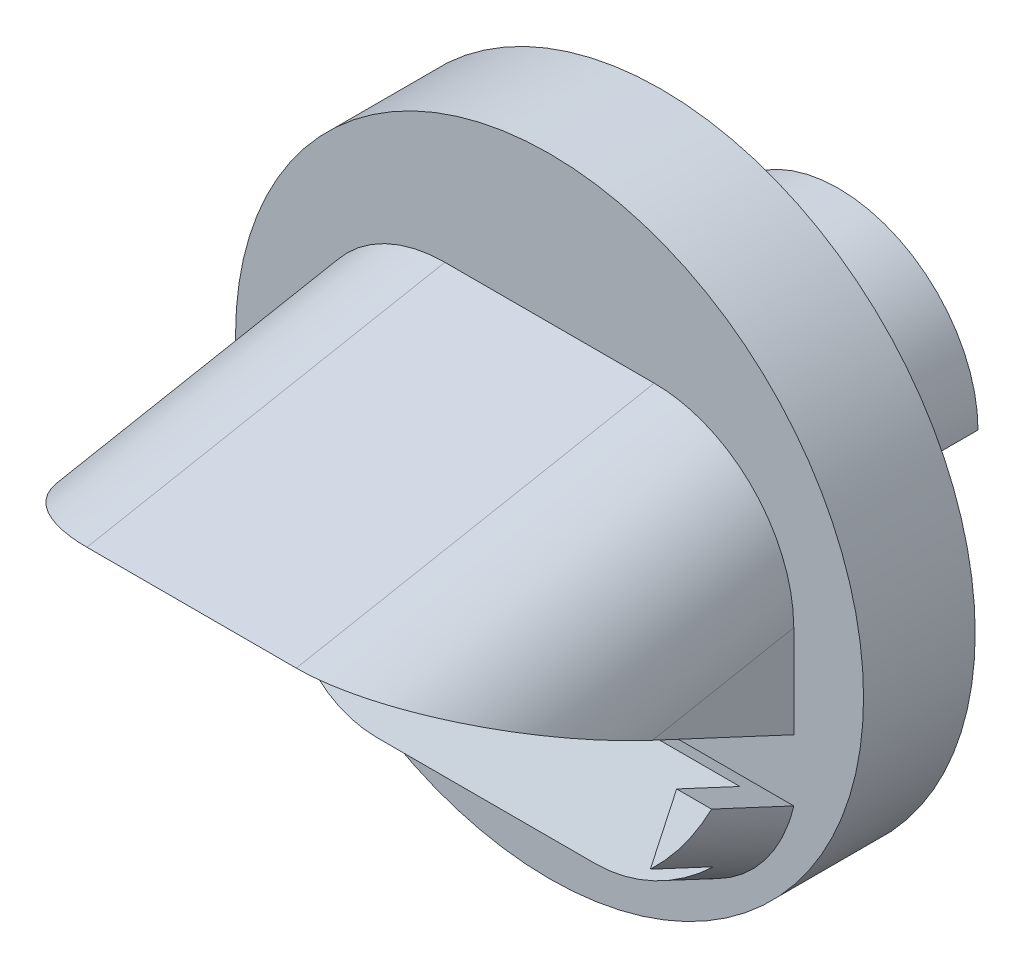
ISO-10303-21;
HEADER;
FILE_DESCRIPTION(('STEP AP214'),'2;1');
FILE_NAME('part.step','',(''),(''),'','','');
FILE_SCHEMA(('AUTOMOTIVE_DESIGN { 1 0 10303 214 1 1 1 1 }'));
ENDSEC;
DATA;
#1=APPLICATION_CONTEXT('core data for automotive mechanical design processes');
#2=APPLICATION_PROTOCOL_DEFINITION('international standard','automotive_design',2000,#1);
#3=PRODUCT_CONTEXT('',#1,'mechanical');
#4=PRODUCT('Part','Part','',(#3));
#5=PRODUCT_RELATED_PRODUCT_CATEGORY('part','',(#4));
#6=PRODUCT_DEFINITION_FORMATION('','',#4);
#7=PRODUCT_DEFINITION_CONTEXT('part definition',#1,'design');
#8=PRODUCT_DEFINITION('design','',#6,#7);
#9=PRODUCT_DEFINITION_SHAPE('','',#8);
#10=(LENGTH_UNIT() NAMED_UNIT(*) SI_UNIT(.MILLI.,.METRE.));
#11=(NAMED_UNIT(*) PLANE_ANGLE_UNIT() SI_UNIT($,.RADIAN.));
#12=(NAMED_UNIT(*) SI_UNIT($,.STERADIAN.) SOLID_ANGLE_UNIT());
#13=UNCERTAINTY_MEASURE_WITH_UNIT(LENGTH_MEASURE(1.E-05),#10,'distance_accuracy_value','');
#14=(GEOMETRIC_REPRESENTATION_CONTEXT(3) GLOBAL_UNCERTAINTY_ASSIGNED_CONTEXT((#13)) GLOBAL_UNIT_ASSIGNED_CONTEXT((#10,
#11,#12)) REPRESENTATION_CONTEXT('',''));
#15=CARTESIAN_POINT('',(0.,0.,0.));
#16=DIRECTION('',(0.,0.,1.));
#17=DIRECTION('',(1.,0.,0.));
#18=AXIS2_PLACEMENT_3D('',#15,#16,#17);
#19=CARTESIAN_POINT('',(0.,0.,20.7));
#20=DIRECTION('',(0.,0.,1.));
#21=DIRECTION('',(1.,0.,0.));
#22=AXIS2_PLACEMENT_3D('',#19,#20,#21);
#23=PLANE('',#22);
#24=CARTESIAN_POINT('',(0.,0.,20.7));
#25=DIRECTION('',(0.,0.,1.));
#26=DIRECTION('',(1.,0.,0.));
#27=AXIS2_PLACEMENT_3D('',#24,#25,#26);
#28=CIRCLE('',#27,22.5);
#29=CARTESIAN_POINT('',(22.5,0.,20.7));
#30=VERTEX_POINT('',#29);
#31=EDGE_CURVE('E246',#30,#30,#28,.T.);
#32=ORIENTED_EDGE('',*,*,#31,.T.);
#33=EDGE_LOOP('',(#32));
#34=FACE_BOUND('',#33,.T.);
#35=DIRECTION('',(0.,1.,0.));
#36=VECTOR('',#35,1.);
#37=CARTESIAN_POINT('',(17.5,0.,20.7));
#38=LINE('',#37,#36);
#39=CARTESIAN_POINT('',(17.5,-4.8111539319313,20.7));
#40=VERTEX_POINT('',#39);
#41=CARTESIAN_POINT('',(17.5,1.82838241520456,20.7));
#42=VERTEX_POINT('',#41);
#43=EDGE_CURVE('E311',#40,#42,#38,.T.);
#44=ORIENTED_EDGE('',*,*,#43,.F.);
#45=DIRECTION('',(-1.,0.,0.));
#46=VECTOR('',#45,1.);
#47=CARTESIAN_POINT('',(17.5,-4.8111539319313,20.7));
#48=LINE('',#47,#46);
#49=CARTESIAN_POINT('',(-17.5,-4.8111539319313,20.7));
#50=VERTEX_POINT('',#49);
#51=EDGE_CURVE('E235',#40,#50,#48,.T.);
#52=ORIENTED_EDGE('',*,*,#51,.T.);
#53=DIRECTION('',(0.,1.,0.));
#54=VECTOR('',#53,1.);
#55=CARTESIAN_POINT('',(-17.5,0.,20.7));
#56=LINE('',#55,#54);
#57=CARTESIAN_POINT('',(-17.5,1.82838241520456,20.7));
#58=VERTEX_POINT('',#57);
#59=EDGE_CURVE('E303',#50,#58,#56,.T.);
#60=ORIENTED_EDGE('',*,*,#59,.T.);
#61=CARTESIAN_POINT('',(-7.5,1.82838241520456,20.7));
#62=DIRECTION('',(0.,0.,1.));
#63=DIRECTION('',(0.,-1.,0.));
#64=AXIS2_PLACEMENT_3D('',#61,#62,#63);
#65=ELLIPSE('',#64,10.1777521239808,10.);
#66=CARTESIAN_POINT('',(-7.5,12.0061345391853,20.7));
#67=VERTEX_POINT('',#66);
#68=EDGE_CURVE('E75',#58,#67,#65,.F.);
#69=ORIENTED_EDGE('',*,*,#68,.T.);
#70=DIRECTION('',(-1.,0.,0.));
#71=VECTOR('',#70,1.);
#72=CARTESIAN_POINT('',(0.,12.0061345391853,20.7));
#73=LINE('',#72,#71);
#74=CARTESIAN_POINT('',(7.5,12.0061345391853,20.7));
#75=VERTEX_POINT('',#74);
#76=EDGE_CURVE('E307',#75,#67,#73,.T.);
#77=ORIENTED_EDGE('',*,*,#76,.F.);
#78=CARTESIAN_POINT('',(7.5,1.82838241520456,20.7));
#79=DIRECTION('',(0.,0.,1.));
#80=DIRECTION('',(0.,1.,0.));
#81=AXIS2_PLACEMENT_3D('',#78,#79,#80);
#82=ELLIPSE('',#81,10.1777521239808,10.);
#83=EDGE_CURVE('E12',#75,#42,#82,.F.);
#84=ORIENTED_EDGE('',*,*,#83,.T.);
#85=EDGE_LOOP('',(#44,#52,#60,#69,#77,#84));
#86=FACE_BOUND('',#85,.T.);
#87=DIRECTION('',(-1.,0.,0.));
#88=VECTOR('',#87,1.);
#89=CARTESIAN_POINT('',(17.5,-9.22466560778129,20.7));
#90=LINE('',#89,#88);
#91=CARTESIAN_POINT('',(17.5,-9.22466560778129,20.7));
#92=VERTEX_POINT('',#91);
#93=CARTESIAN_POINT('',(-17.5,-9.22466560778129,20.7));
#94=VERTEX_POINT('',#93);
#95=EDGE_CURVE('E215',#92,#94,#90,.T.);
#96=ORIENTED_EDGE('',*,*,#95,.F.);
#97=CARTESIAN_POINT('',(7.81754163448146,-6.46622081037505,20.7));
#98=DIRECTION('',(0.,0.,1.));
#99=DIRECTION('',(0.,1.,0.));
#100=AXIS2_PLACEMENT_3D('',#97,#98,#99);
#101=ELLIPSE('',#100,11.0337791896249,10.);
#102=CARTESIAN_POINT('',(7.81754163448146,-17.5,20.7));
#103=VERTEX_POINT('',#102);
#104=EDGE_CURVE('E342',#92,#103,#101,.F.);
#105=ORIENTED_EDGE('',*,*,#104,.T.);
#106=DIRECTION('',(1.,0.,0.));
#107=VECTOR('',#106,1.);
#108=CARTESIAN_POINT('',(0.,-17.5,20.7));
#109=LINE('',#108,#107);
#110=CARTESIAN_POINT('',(-7.81754163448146,-17.5,20.7));
#111=VERTEX_POINT('',#110);
#112=EDGE_CURVE('E314',#111,#103,#109,.T.);
#113=ORIENTED_EDGE('',*,*,#112,.F.);
#114=CARTESIAN_POINT('',(-7.81754163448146,-6.46622081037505,20.7));
#115=DIRECTION('',(0.,0.,1.));
#116=DIRECTION('',(0.,1.,0.));
#117=AXIS2_PLACEMENT_3D('',#114,#115,#116);
#118=ELLIPSE('',#117,11.0337791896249,10.);
#119=EDGE_CURVE('E345',#111,#94,#118,.F.);
#120=ORIENTED_EDGE('',*,*,#119,.T.);
#121=EDGE_LOOP('',(#96,#105,#113,#120));
#122=FACE_BOUND('',#121,.T.);
#123=ADVANCED_FACE('F66',(#34,#86,#122),#23,.T.);
#124=CARTESIAN_POINT('',(2.725,0.,12.7));
#125=DIRECTION('',(0.,1.,0.));
#126=DIRECTION('',(0.,0.,1.));
#127=AXIS2_PLACEMENT_3D('',#124,#125,#126);
#128=PLANE('',#127);
#129=CARTESIAN_POINT('',(6.3625,0.,7.));
#130=DIRECTION('',(0.,-1.,0.));
#131=DIRECTION('',(0.,0.,1.));
#132=AXIS2_PLACEMENT_3D('',#129,#130,#131);
#133=CIRCLE('',#132,2.05);
#134=CARTESIAN_POINT('',(6.3625,0.,9.05));
#135=VERTEX_POINT('',#134);
#136=EDGE_CURVE('E250',#135,#135,#133,.T.);
#137=ORIENTED_EDGE('',*,*,#136,.F.);
#138=EDGE_LOOP('',(#137));
#139=FACE_BOUND('',#138,.T.);
#140=DIRECTION('',(1.,0.,0.));
#141=VECTOR('',#140,1.);
#142=CARTESIAN_POINT('',(2.725,0.,0.));
#143=LINE('',#142,#141);
#144=CARTESIAN_POINT('',(2.725,0.,0.));
#145=VERTEX_POINT('',#144);
#146=CARTESIAN_POINT('',(10.,0.,0.));
#147=VERTEX_POINT('',#146);
#148=EDGE_CURVE('E300',#145,#147,#143,.T.);
#149=ORIENTED_EDGE('',*,*,#148,.T.);
#150=DIRECTION('',(0.,0.,-1.));
#151=VECTOR('',#150,1.);
#152=CARTESIAN_POINT('',(10.,0.,12.7));
#153=LINE('',#152,#151);
#154=CARTESIAN_POINT('',(10.,0.,12.7));
#155=VERTEX_POINT('',#154);
#156=EDGE_CURVE('E301',#155,#147,#153,.T.);
#157=ORIENTED_EDGE('',*,*,#156,.F.);
#158=DIRECTION('',(1.,0.,0.));
#159=VECTOR('',#158,1.);
#160=CARTESIAN_POINT('',(2.725,0.,12.7));
#161=LINE('',#160,#159);
#162=CARTESIAN_POINT('',(2.725,0.,12.7));
#163=VERTEX_POINT('',#162);
#164=EDGE_CURVE('E271',#163,#155,#161,.T.);
#165=ORIENTED_EDGE('',*,*,#164,.F.);
#166=DIRECTION('',(0.,0.,-1.));
#167=VECTOR('',#166,1.);
#168=CARTESIAN_POINT('',(2.725,0.,12.7));
#169=LINE('',#168,#167);
#170=EDGE_CURVE('E424',#163,#145,#169,.T.);
#171=ORIENTED_EDGE('',*,*,#170,.T.);
#172=EDGE_LOOP('',(#149,#157,#165,#171));
#173=FACE_BOUND('',#172,.T.);
#174=ADVANCED_FACE('F392',(#139,#173),#128,.F.);
#175=CARTESIAN_POINT('',(0.,0.,12.7));
#176=DIRECTION('',(0.,0.,-1.));
#177=DIRECTION('',(-1.,0.,0.));
#178=AXIS2_PLACEMENT_3D('',#175,#176,#177);
#179=CYLINDRICAL_SURFACE('',#178,10.);
#180=CARTESIAN_POINT('',(-6.3625,7.71482946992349,4.95));
#181=CARTESIAN_POINT('',(-6.22789997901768,7.82582957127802,4.94999992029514));
#182=CARTESIAN_POINT('',(-6.09027888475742,7.93336559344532,4.96323208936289));
#183=CARTESIAN_POINT('',(-5.81358151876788,8.13828982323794,5.01983749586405));
#184=CARTESIAN_POINT('',(-5.67450741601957,8.23569128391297,5.06317078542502));
#185=CARTESIAN_POINT('',(-5.43834276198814,8.3927901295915,5.16687610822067));
#186=CARTESIAN_POINT('',(-5.33996266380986,8.45560836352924,5.2196026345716));
#187=CARTESIAN_POINT('',(-5.14977632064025,8.5727613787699,5.34330437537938));
#188=CARTESIAN_POINT('',(-5.05796630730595,8.62710104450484,5.4142690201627));
#189=CARTESIAN_POINT('',(-4.88454925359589,8.72646876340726,5.57445536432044));
#190=CARTESIAN_POINT('',(-4.80301056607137,8.7714356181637,5.66378992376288));
#191=CARTESIAN_POINT('',(-4.65532079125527,8.85070863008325,5.8585345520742));
#192=CARTESIAN_POINT('',(-4.58916283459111,8.88501954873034,5.96393740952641));
#193=CARTESIAN_POINT('',(-4.48252148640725,8.93925008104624,6.17502189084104));
#194=CARTESIAN_POINT('',(-4.44000556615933,8.96034301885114,6.27937866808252));
#195=CARTESIAN_POINT('',(-4.37248139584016,8.99348870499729,6.49496161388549));
#196=CARTESIAN_POINT('',(-4.34746496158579,9.00554567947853,6.60618454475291));
#197=CARTESIAN_POINT('',(-4.31733109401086,9.02002813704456,6.82389808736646));
#198=CARTESIAN_POINT('',(-4.31094178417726,9.02306948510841,6.93017395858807));
#199=CARTESIAN_POINT('',(-4.31469978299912,9.02127332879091,7.14235494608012));
#200=CARTESIAN_POINT('',(-4.32484378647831,9.016437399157,7.24826013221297));
#201=CARTESIAN_POINT('',(-4.36085418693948,8.99907400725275,7.45462175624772));
#202=CARTESIAN_POINT('',(-4.38642057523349,8.98669326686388,7.55514327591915));
#203=CARTESIAN_POINT('',(-4.45189571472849,8.95443727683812,7.75011138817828));
#204=CARTESIAN_POINT('',(-4.49180449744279,8.93456201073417,7.84455796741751));
#205=CARTESIAN_POINT('',(-4.58513064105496,8.88703300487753,8.02670532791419));
#206=CARTESIAN_POINT('',(-4.63878490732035,8.8592417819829,8.11424842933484));
#207=CARTESIAN_POINT('',(-4.75697164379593,8.79634540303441,8.27868660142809));
#208=CARTESIAN_POINT('',(-4.8215061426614,8.76123888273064,8.35557968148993));
#209=CARTESIAN_POINT('',(-4.96310973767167,8.68184892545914,8.50172259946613));
#210=CARTESIAN_POINT('',(-5.04069899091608,8.63714083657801,8.57023559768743));
#211=CARTESIAN_POINT('',(-5.20235949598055,8.54074473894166,8.69319301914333));
#212=CARTESIAN_POINT('',(-5.28643272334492,8.48905459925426,8.74763313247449));
#213=CARTESIAN_POINT('',(-5.46815698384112,8.37329779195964,8.84786508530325));
#214=CARTESIAN_POINT('',(-5.56626476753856,8.30849212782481,8.89196917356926));
#215=CARTESIAN_POINT('',(-5.76408993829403,8.17249881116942,8.96354175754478));
#216=CARTESIAN_POINT('',(-5.86380855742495,8.10130606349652,8.99099683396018));
#217=CARTESIAN_POINT('',(-6.10539811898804,7.92182927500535,9.03897673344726));
#218=CARTESIAN_POINT('',(-6.24686874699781,7.81080819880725,9.05138375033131));
#219=CARTESIAN_POINT('',(-6.52338136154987,7.58142076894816,9.04836655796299));
#220=CARTESIAN_POINT('',(-6.65841401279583,7.46304428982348,9.03290312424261));
#221=CARTESIAN_POINT('',(-6.9208220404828,7.22042784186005,8.97711979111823));
#222=CARTESIAN_POINT('',(-7.04807610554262,7.09613191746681,8.93648168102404));
#223=CARTESIAN_POINT('',(-7.29134211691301,6.84592980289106,8.83229183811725));
#224=CARTESIAN_POINT('',(-7.40734655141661,6.72002259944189,8.76872492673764));
#225=CARTESIAN_POINT('',(-7.57007650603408,6.53456143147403,8.65782750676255));
#226=CARTESIAN_POINT('',(-7.62176004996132,6.47417041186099,8.61894898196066));
#227=CARTESIAN_POINT('',(-7.72188745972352,6.35441022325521,8.53583868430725));
#228=CARTESIAN_POINT('',(-7.77033259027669,6.2950406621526,8.49160902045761));
#229=CARTESIAN_POINT('',(-7.86365491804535,6.17806779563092,8.39764549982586));
#230=CARTESIAN_POINT('',(-7.90853756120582,6.12046188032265,8.34792033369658));
#231=CARTESIAN_POINT('',(-7.99441283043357,6.00785906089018,8.24256829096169));
#232=CARTESIAN_POINT('',(-8.03540809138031,5.95286040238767,8.18694546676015));
#233=CARTESIAN_POINT('',(-8.11622284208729,5.84225922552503,8.06432889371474));
#234=CARTESIAN_POINT('',(-8.1556576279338,5.78699049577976,7.99677330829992));
#235=CARTESIAN_POINT('',(-8.22817121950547,5.68341282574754,7.85335411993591));
#236=CARTESIAN_POINT('',(-8.26125694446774,5.63509632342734,7.77749970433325));
#237=CARTESIAN_POINT('',(-8.31333514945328,5.55789273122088,7.63351038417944));
#238=CARTESIAN_POINT('',(-8.33382641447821,5.52705318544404,7.56698512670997));
#239=CARTESIAN_POINT('',(-8.36840424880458,5.47455991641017,7.42882426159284));
#240=CARTESIAN_POINT('',(-8.38250206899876,5.45289006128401,7.35719788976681));
#241=CARTESIAN_POINT('',(-8.40138742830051,5.42373904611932,7.22207488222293));
#242=CARTESIAN_POINT('',(-8.4073041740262,5.41454173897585,7.1591125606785));
#243=CARTESIAN_POINT('',(-8.41322767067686,5.40533388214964,7.03224813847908));
#244=CARTESIAN_POINT('',(-8.41323768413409,5.40531826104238,6.96834657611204));
#245=CARTESIAN_POINT('',(-8.40735458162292,5.41446342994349,6.84159030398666));
#246=CARTESIAN_POINT('',(-8.40146940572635,5.42361187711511,6.77873430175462));
#247=CARTESIAN_POINT('',(-8.38431296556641,5.45009541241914,6.65553912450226));
#248=CARTESIAN_POINT('',(-8.37303652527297,5.46743836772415,6.5952024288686));
#249=CARTESIAN_POINT('',(-8.34009379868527,5.51761405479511,6.45323920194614));
#250=CARTESIAN_POINT('',(-8.31605047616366,5.55389562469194,6.37339654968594));
#251=CARTESIAN_POINT('',(-8.26065890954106,5.63595271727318,6.22149313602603));
#252=CARTESIAN_POINT('',(-8.22929176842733,5.68175276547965,6.14945322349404));
#253=CARTESIAN_POINT('',(-8.16739615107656,5.77026681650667,6.02601234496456));
#254=CARTESIAN_POINT('',(-8.13786138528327,5.81188701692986,5.97330338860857));
#255=CARTESIAN_POINT('',(-8.07556782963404,5.8981391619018,5.87243070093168));
#256=CARTESIAN_POINT('',(-8.04280706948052,5.94277294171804,5.82426978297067));
#257=CARTESIAN_POINT('',(-7.94015919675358,6.08003830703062,5.6859513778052));
#258=CARTESIAN_POINT('',(-7.86599272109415,6.17590861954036,5.60212307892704));
#259=CARTESIAN_POINT('',(-7.72992883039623,6.3448086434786,5.47063769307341));
#260=CARTESIAN_POINT('',(-7.67023717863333,6.41689978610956,5.41936296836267));
#261=CARTESIAN_POINT('',(-7.54624566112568,6.56226235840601,5.32448696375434));
#262=CARTESIAN_POINT('',(-7.48194364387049,6.63553432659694,5.28088929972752));
#263=CARTESIAN_POINT('',(-7.34919925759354,6.78225983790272,5.20141797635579));
#264=CARTESIAN_POINT('',(-7.28076354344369,6.85571291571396,5.16553230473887));
#265=CARTESIAN_POINT('',(-7.13995186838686,7.0022438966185,5.10156677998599));
#266=CARTESIAN_POINT('',(-7.06757557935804,7.07532176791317,5.07348757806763));
#267=CARTESIAN_POINT('',(-6.894037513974,7.24510344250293,5.01735828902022));
#268=CARTESIAN_POINT('',(-6.79142795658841,7.3414272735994,4.99253832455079));
#269=CARTESIAN_POINT('',(-6.58072060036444,7.53088401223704,4.95885713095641));
#270=CARTESIAN_POINT('',(-6.47262137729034,7.62401608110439,4.95000006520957));
#271=CARTESIAN_POINT('',(-6.3625,7.71482946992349,4.95));
#272=B_SPLINE_CURVE_WITH_KNOTS('',3,(#180,#181,#182,#183,#184,#185,#186,#187,#188,#189,#190,
#191,#192,#193,#194,#195,#196,#197,#198,#199,#200,#201,#202,#203,#204,#205,#206,#207,#208,#209,
#210,#211,#212,#213,#214,#215,#216,#217,#218,#219,#220,#221,#222,#223,#224,#225,#226,#227,#228,
#229,#230,#231,#232,#233,#234,#235,#236,#237,#238,#239,#240,#241,#242,#243,#244,#245,#246,#247,
#248,#249,#250,#251,#252,#253,#254,#255,#256,#257,#258,#259,#260,#261,#262,#263,#264,#265,#266,
#267,#268,#269,#270,#271),.UNSPECIFIED.,.T.,.F.,(4,2,2,2,2,2,2,2,2,2,2,2,2,2,2,2,2,2,2,2,2,2,2,
2,2,2,2,2,2,2,2,2,2,2,2,2,2,2,2,2,2,2,2,2,2,4),(0.,0.522927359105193,1.04516205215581,
1.42786943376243,1.81035552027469,2.19526574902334,2.58000373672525,2.92211330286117,
3.26406276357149,3.58204391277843,3.8999615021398,4.21188561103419,4.52381040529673,
4.84152280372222,5.15929450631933,5.49615943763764,5.83312741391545,6.20841918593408,
6.5840130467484,7.12186542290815,7.66047535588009,8.20603634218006,8.75195914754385,
9.01724016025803,9.28241695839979,9.54718024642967,9.81176277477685,10.0984609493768,
10.3848448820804,10.6124666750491,10.8396863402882,11.0305287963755,11.2212658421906,
11.4117463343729,11.6024100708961,11.8736828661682,12.1456634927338,12.3654623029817,
12.585396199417,13.0259295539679,13.3457666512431,13.6657539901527,13.9852392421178,
14.3047511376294,14.7324662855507,15.1602929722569),.UNSPECIFIED.);
#273=CARTESIAN_POINT('',(-6.3625,7.71482946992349,4.95));
#274=VERTEX_POINT('',#273);
#275=EDGE_CURVE('E258',#274,#274,#272,.T.);
#276=ORIENTED_EDGE('',*,*,#275,.T.);
#277=EDGE_LOOP('',(#276));
#278=FACE_BOUND('',#277,.T.);
#279=CARTESIAN_POINT('',(6.3625,7.71482946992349,4.95));
#280=CARTESIAN_POINT('',(6.49607731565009,7.6046619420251,4.94999828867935));
#281=CARTESIAN_POINT('',(6.62680097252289,7.49098560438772,4.96303691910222));
#282=CARTESIAN_POINT('',(6.8799884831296,7.25915469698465,5.0121891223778));
#283=CARTESIAN_POINT('',(7.00243495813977,7.14099147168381,5.04834967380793));
#284=CARTESIAN_POINT('',(7.18768609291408,6.95316910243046,5.12199512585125));
#285=CARTESIAN_POINT('',(7.25389625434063,6.88403447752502,5.15251249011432));
#286=CARTESIAN_POINT('',(7.38267657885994,6.74573939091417,5.22038269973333));
#287=CARTESIAN_POINT('',(7.44524758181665,6.67657893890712,5.25773395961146));
#288=CARTESIAN_POINT('',(7.56647025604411,6.53887896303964,5.33919073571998));
#289=CARTESIAN_POINT('',(7.62512403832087,6.47033912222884,5.38329257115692));
#290=CARTESIAN_POINT('',(7.73822819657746,6.33463678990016,5.47838024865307));
#291=CARTESIAN_POINT('',(7.79268051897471,6.26747367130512,5.52936287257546));
#292=CARTESIAN_POINT('',(7.90982635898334,6.11928115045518,5.65198438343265));
#293=CARTESIAN_POINT('',(7.97126483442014,6.03889179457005,5.72562249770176));
#294=CARTESIAN_POINT('',(8.08576182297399,5.88469386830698,5.88531945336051));
#295=CARTESIAN_POINT('',(8.13883183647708,5.81087632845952,5.97136093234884));
#296=CARTESIAN_POINT('',(8.22050292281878,5.69445807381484,6.13060538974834));
#297=CARTESIAN_POINT('',(8.25174367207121,5.64899987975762,6.2003360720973));
#298=CARTESIAN_POINT('',(8.30740469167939,5.56681955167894,6.3473187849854));
#299=CARTESIAN_POINT('',(8.33183728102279,5.53008165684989,6.42455688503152));
#300=CARTESIAN_POINT('',(8.36717092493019,5.47642521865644,6.56665237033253));
#301=CARTESIAN_POINT('',(8.37991174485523,5.45686672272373,6.63003883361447));
#302=CARTESIAN_POINT('',(8.39943204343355,5.42677338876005,6.75980013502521));
#303=CARTESIAN_POINT('',(8.40621908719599,5.41622709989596,6.82617106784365));
#304=CARTESIAN_POINT('',(8.41322489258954,5.4053395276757,6.96045474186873));
#305=CARTESIAN_POINT('',(8.41341090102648,5.40504913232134,7.02837349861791));
#306=CARTESIAN_POINT('',(8.4071133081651,5.4148383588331,7.16315055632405));
#307=CARTESIAN_POINT('',(8.40062541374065,5.42492465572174,7.23000814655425));
#308=CARTESIAN_POINT('',(8.38017884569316,5.45646369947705,7.3704494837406));
#309=CARTESIAN_POINT('',(8.36525261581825,5.47938377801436,7.4435548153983));
#310=CARTESIAN_POINT('',(8.32880432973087,5.53462832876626,7.58434938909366));
#311=CARTESIAN_POINT('',(8.30726993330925,5.56697038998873,7.65202819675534));
#312=CARTESIAN_POINT('',(8.24635105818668,5.65702633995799,7.8152700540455));
#313=CARTESIAN_POINT('',(8.20350579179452,5.71919127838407,7.90704796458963));
#314=CARTESIAN_POINT('',(8.10873320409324,5.85279468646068,8.07832770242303));
#315=CARTESIAN_POINT('',(8.05678183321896,5.92425758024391,8.15779594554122));
#316=CARTESIAN_POINT('',(7.95636616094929,6.05820471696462,8.29136982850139));
#317=CARTESIAN_POINT('',(7.90917418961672,6.11974845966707,8.34740704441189));
#318=CARTESIAN_POINT('',(7.81055836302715,6.24512147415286,8.45287453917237));
#319=CARTESIAN_POINT('',(7.75913208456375,6.30895204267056,8.50230099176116));
#320=CARTESIAN_POINT('',(7.65240573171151,6.43798885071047,8.59487749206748));
#321=CARTESIAN_POINT('',(7.59710320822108,6.50319594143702,8.6380235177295));
#322=CARTESIAN_POINT('',(7.48291387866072,6.63427279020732,8.71814908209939));
#323=CARTESIAN_POINT('',(7.42402568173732,6.70014279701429,8.75512620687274));
#324=CARTESIAN_POINT('',(7.23765468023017,6.90295609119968,8.85941162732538));
#325=CARTESIAN_POINT('',(7.10452893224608,7.04012912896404,8.9165573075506));
#326=CARTESIAN_POINT('',(6.82591475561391,7.31057603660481,9.0022314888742));
#327=CARTESIAN_POINT('',(6.6804409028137,7.44385426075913,9.03079323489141));
#328=CARTESIAN_POINT('',(6.4052881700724,7.68111780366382,9.0533853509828));
#329=CARTESIAN_POINT('',(6.27704072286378,7.78627242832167,9.05239508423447));
#330=CARTESIAN_POINT('',(6.01714223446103,7.98880493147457,9.02490755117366));
#331=CARTESIAN_POINT('',(5.88549557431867,8.08619221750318,8.99844166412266));
#332=CARTESIAN_POINT('',(5.64746437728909,8.25368718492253,8.92452474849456));
#333=CARTESIAN_POINT('',(5.5408495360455,8.32553146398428,8.8817787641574));
#334=CARTESIAN_POINT('',(5.33217950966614,8.46069024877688,8.77611729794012));
#335=CARTESIAN_POINT('',(5.23012302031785,8.52400720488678,8.71320762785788));
#336=CARTESIAN_POINT('',(5.03441402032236,8.64105266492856,8.56644520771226));
#337=CARTESIAN_POINT('',(4.94083025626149,8.69470571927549,8.48243897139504));
#338=CARTESIAN_POINT('',(4.76826990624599,8.79052730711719,8.29503258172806));
#339=CARTESIAN_POINT('',(4.68928265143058,8.83270423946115,8.19164670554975));
#340=CARTESIAN_POINT('',(4.56023337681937,8.89993658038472,7.98351033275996));
#341=CARTESIAN_POINT('',(4.50772218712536,8.92652257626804,7.88076764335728));
#342=CARTESIAN_POINT('',(4.42030628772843,8.97013374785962,7.66616715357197));
#343=CARTESIAN_POINT('',(4.38539138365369,8.98716446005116,7.55431467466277));
#344=CARTESIAN_POINT('',(4.33730838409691,9.01046080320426,7.3354590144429));
#345=CARTESIAN_POINT('',(4.32248990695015,9.01754538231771,7.22890200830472));
#346=CARTESIAN_POINT('',(4.30974520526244,9.02364407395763,7.01456375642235));
#347=CARTESIAN_POINT('',(4.31181448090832,9.02266033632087,6.90678284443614));
#348=CARTESIAN_POINT('',(4.3324292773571,9.01277840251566,6.69643227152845));
#349=CARTESIAN_POINT('',(4.35048452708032,9.00411570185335,6.59380284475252));
#350=CARTESIAN_POINT('',(4.4015969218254,8.97923966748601,6.39332096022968));
#351=CARTESIAN_POINT('',(4.43465353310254,8.96302660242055,6.2954683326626));
#352=CARTESIAN_POINT('',(4.51472339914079,8.92296379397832,6.10619771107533));
#353=CARTESIAN_POINT('',(4.56186766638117,8.8990421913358,6.01485055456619));
#354=CARTESIAN_POINT('',(4.66799001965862,8.84383601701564,5.84179221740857));
#355=CARTESIAN_POINT('',(4.72696952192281,8.81255056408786,5.76008219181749));
#356=CARTESIAN_POINT('',(4.85754101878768,8.74128572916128,5.60413531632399));
#357=CARTESIAN_POINT('',(4.92960791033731,8.70095670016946,5.53045743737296));
#358=CARTESIAN_POINT('',(5.08136885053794,8.61320930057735,5.3964207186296));
#359=CARTESIAN_POINT('',(5.1610656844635,8.56578833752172,5.33606676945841));
#360=CARTESIAN_POINT('',(5.33358289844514,8.4595586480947,5.22363846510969));
#361=CARTESIAN_POINT('',(5.42691950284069,8.40008593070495,5.17298950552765));
#362=CARTESIAN_POINT('',(5.61641512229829,8.27458828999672,5.08775902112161));
#363=CARTESIAN_POINT('',(5.71257495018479,8.20856146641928,5.05318217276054));
#364=CARTESIAN_POINT('',(5.90196850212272,8.07340388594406,5.00006000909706));
#365=CARTESIAN_POINT('',(5.99519227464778,8.00445133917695,4.98101620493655));
#366=CARTESIAN_POINT('',(6.18021391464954,7.86247918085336,4.95598654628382));
#367=CARTESIAN_POINT('',(6.27201173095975,7.78945942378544,4.95000115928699));
#368=CARTESIAN_POINT('',(6.3625,7.71482946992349,4.95));
#369=B_SPLINE_CURVE_WITH_KNOTS('',3,(#279,#280,#281,#282,#283,#284,#285,#286,#287,#288,#289,
#290,#291,#292,#293,#294,#295,#296,#297,#298,#299,#300,#301,#302,#303,#304,#305,#306,#307,#308,
#309,#310,#311,#312,#313,#314,#315,#316,#317,#318,#319,#320,#321,#322,#323,#324,#325,#326,#327,
#328,#329,#330,#331,#332,#333,#334,#335,#336,#337,#338,#339,#340,#341,#342,#343,#344,#345,#346,
#347,#348,#349,#350,#351,#352,#353,#354,#355,#356,#357,#358,#359,#360,#361,#362,#363,#364,#365,
#366,#367,#368),.UNSPECIFIED.,.T.,.F.,(4,2,2,2,2,2,2,2,2,2,2,2,2,2,2,2,2,2,2,2,2,2,2,2,2,2,2,2,
2,2,2,2,2,2,2,2,2,2,2,2,2,2,2,2,4),(0.,0.51910212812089,1.03926232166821,1.34042110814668,
1.6415101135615,1.94243552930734,2.24322068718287,2.61779002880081,2.99184004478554,
3.25782659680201,3.52332868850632,3.72518152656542,3.92677750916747,4.12937363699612,
4.33210017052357,4.56497615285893,4.79828968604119,5.15284164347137,5.5083444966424,
5.79501687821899,6.0818544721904,6.36887495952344,6.6560074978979,7.25202307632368,
7.84734464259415,8.34302869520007,8.83810297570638,9.24292675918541,9.64763396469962,
10.0553754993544,10.462817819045,10.816105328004,11.1691879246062,11.4910396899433,
11.8128056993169,12.1250326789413,12.4372485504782,12.7524634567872,13.0677161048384,
13.3983468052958,13.7290986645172,14.0928264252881,14.4566599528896,14.8082987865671,
15.1599502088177),.UNSPECIFIED.);
#370=CARTESIAN_POINT('',(6.3625,7.71482946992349,4.95));
#371=VERTEX_POINT('',#370);
#372=EDGE_CURVE('E270',#371,#371,#369,.T.);
#373=ORIENTED_EDGE('',*,*,#372,.T.);
#374=EDGE_LOOP('',(#373));
#375=FACE_BOUND('',#374,.T.);
#376=CARTESIAN_POINT('',(0.,0.,0.));
#377=DIRECTION('',(0.,0.,1.));
#378=DIRECTION('',(1.,0.,0.));
#379=AXIS2_PLACEMENT_3D('',#376,#377,#378);
#380=CIRCLE('',#379,10.);
#381=CARTESIAN_POINT('',(-10.,0.,0.));
#382=VERTEX_POINT('',#381);
#383=EDGE_CURVE('E448',#147,#382,#380,.T.);
#384=ORIENTED_EDGE('',*,*,#383,.T.);
#385=DIRECTION('',(0.,0.,-1.));
#386=VECTOR('',#385,1.);
#387=CARTESIAN_POINT('',(-10.,0.,12.7));
#388=LINE('',#387,#386);
#389=CARTESIAN_POINT('',(-10.,0.,12.7));
#390=VERTEX_POINT('',#389);
#391=EDGE_CURVE('E453',#390,#382,#388,.T.);
#392=ORIENTED_EDGE('',*,*,#391,.F.);
#393=CARTESIAN_POINT('',(0.,0.,12.7));
#394=DIRECTION('',(0.,0.,1.));
#395=DIRECTION('',(1.,0.,0.));
#396=AXIS2_PLACEMENT_3D('',#393,#394,#395);
#397=CIRCLE('',#396,10.);
#398=EDGE_CURVE('E439',#155,#390,#397,.T.);
#399=ORIENTED_EDGE('',*,*,#398,.F.);
#400=ORIENTED_EDGE('',*,*,#156,.T.);
#401=EDGE_LOOP('',(#384,#392,#399,#400));
#402=FACE_BOUND('',#401,.T.);
#403=ADVANCED_FACE('F273',(#278,#375,#402),#179,.T.);
#404=CARTESIAN_POINT('',(-10.,0.,12.7));
#405=DIRECTION('',(0.,1.,0.));
#406=DIRECTION('',(0.,0.,1.));
#407=AXIS2_PLACEMENT_3D('',#404,#405,#406);
#408=PLANE('',#407);
#409=CARTESIAN_POINT('',(-6.3625,0.,7.));
#410=DIRECTION('',(0.,-1.,0.));
#411=DIRECTION('',(0.,0.,-1.));
#412=AXIS2_PLACEMENT_3D('',#409,#410,#411);
#413=CIRCLE('',#412,2.05);
#414=CARTESIAN_POINT('',(-6.3625,0.,4.95));
#415=VERTEX_POINT('',#414);
#416=EDGE_CURVE('E254',#415,#415,#413,.T.);
#417=ORIENTED_EDGE('',*,*,#416,.F.);
#418=EDGE_LOOP('',(#417));
#419=FACE_BOUND('',#418,.T.);
#420=DIRECTION('',(1.,0.,0.));
#421=VECTOR('',#420,1.);
#422=CARTESIAN_POINT('',(-10.,0.,0.));
#423=LINE('',#422,#421);
#424=CARTESIAN_POINT('',(-2.725,0.,0.));
#425=VERTEX_POINT('',#424);
#426=EDGE_CURVE('E442',#382,#425,#423,.T.);
#427=ORIENTED_EDGE('',*,*,#426,.T.);
#428=DIRECTION('',(0.,0.,-1.));
#429=VECTOR('',#428,1.);
#430=CARTESIAN_POINT('',(-2.725,0.,12.7));
#431=LINE('',#430,#429);
#432=CARTESIAN_POINT('',(-2.725,0.,12.7));
#433=VERTEX_POINT('',#432);
#434=EDGE_CURVE('E434',#433,#425,#431,.T.);
#435=ORIENTED_EDGE('',*,*,#434,.F.);
#436=DIRECTION('',(1.,0.,0.));
#437=VECTOR('',#436,1.);
#438=CARTESIAN_POINT('',(-10.,0.,12.7));
#439=LINE('',#438,#437);
#440=EDGE_CURVE('E420',#390,#433,#439,.T.);
#441=ORIENTED_EDGE('',*,*,#440,.F.);
#442=ORIENTED_EDGE('',*,*,#391,.T.);
#443=EDGE_LOOP('',(#427,#435,#441,#442));
#444=FACE_BOUND('',#443,.T.);
#445=ADVANCED_FACE('F465',(#419,#444),#408,.F.);
#446=CARTESIAN_POINT('',(0.,0.,12.7));
#447=DIRECTION('',(0.,0.,-1.));
#448=DIRECTION('',(-1.,0.,0.));
#449=AXIS2_PLACEMENT_3D('',#446,#447,#448);
#450=CYLINDRICAL_SURFACE('',#449,2.725);
#451=CARTESIAN_POINT('',(0.,0.,0.));
#452=DIRECTION('',(0.,0.,1.));
#453=DIRECTION('',(1.,0.,0.));
#454=AXIS2_PLACEMENT_3D('',#451,#452,#453);
#455=CIRCLE('',#454,2.725);
#456=EDGE_CURVE('E429',#145,#425,#455,.T.);
#457=ORIENTED_EDGE('',*,*,#456,.F.);
#458=ORIENTED_EDGE('',*,*,#170,.F.);
#459=CARTESIAN_POINT('',(0.,0.,12.7));
#460=DIRECTION('',(0.,0.,1.));
#461=DIRECTION('',(1.,0.,0.));
#462=AXIS2_PLACEMENT_3D('',#459,#460,#461);
#463=CIRCLE('',#462,2.725);
#464=EDGE_CURVE('E413',#163,#433,#463,.T.);
#465=ORIENTED_EDGE('',*,*,#464,.T.);
#466=ORIENTED_EDGE('',*,*,#434,.T.);
#467=EDGE_LOOP('',(#457,#458,#465,#466));
#468=FACE_BOUND('',#467,.T.);
#469=ADVANCED_FACE('F427',(#468),#450,.F.);
#470=CARTESIAN_POINT('',(0.,0.,0.));
#471=DIRECTION('',(0.,0.,1.));
#472=DIRECTION('',(1.,0.,0.));
#473=AXIS2_PLACEMENT_3D('',#470,#471,#472);
#474=PLANE('',#473);
#475=ORIENTED_EDGE('',*,*,#148,.F.);
#476=ORIENTED_EDGE('',*,*,#456,.T.);
#477=ORIENTED_EDGE('',*,*,#426,.F.);
#478=ORIENTED_EDGE('',*,*,#383,.F.);
#479=EDGE_LOOP('',(#475,#476,#477,#478));
#480=FACE_BOUND('',#479,.T.);
#481=ADVANCED_FACE('F283',(#480),#474,.F.);
#482=CARTESIAN_POINT('',(-6.3625,10.,7.));
#483=DIRECTION('',(0.,-1.,0.));
#484=DIRECTION('',(0.,0.,-1.));
#485=AXIS2_PLACEMENT_3D('',#482,#483,#484);
#486=CYLINDRICAL_SURFACE('',#485,2.05);
#487=ORIENTED_EDGE('',*,*,#416,.T.);
#488=EDGE_LOOP('',(#487));
#489=FACE_BOUND('',#488,.T.);
#490=ORIENTED_EDGE('',*,*,#275,.F.);
#491=EDGE_LOOP('',(#490));
#492=FACE_BOUND('',#491,.T.);
#493=ADVANCED_FACE('F277',(#489,#492),#486,.F.);
#494=CARTESIAN_POINT('',(6.3625,10.,7.));
#495=DIRECTION('',(0.,-1.,0.));
#496=DIRECTION('',(0.,0.,-1.));
#497=AXIS2_PLACEMENT_3D('',#494,#495,#496);
#498=CYLINDRICAL_SURFACE('',#497,2.05);
#499=ORIENTED_EDGE('',*,*,#136,.T.);
#500=EDGE_LOOP('',(#499));
#501=FACE_BOUND('',#500,.T.);
#502=ORIENTED_EDGE('',*,*,#372,.F.);
#503=EDGE_LOOP('',(#502));
#504=FACE_BOUND('',#503,.T.);
#505=ADVANCED_FACE('F282',(#501,#504),#498,.F.);
#506=CARTESIAN_POINT('',(0.,0.,20.7));
#507=DIRECTION('',(0.,0.,-1.));
#508=DIRECTION('',(-1.,0.,0.));
#509=AXIS2_PLACEMENT_3D('',#506,#507,#508);
#510=CYLINDRICAL_SURFACE('',#509,22.5);
#511=ORIENTED_EDGE('',*,*,#31,.F.);
#512=EDGE_LOOP('',(#511));
#513=FACE_BOUND('',#512,.T.);
#514=CARTESIAN_POINT('',(0.,0.,12.7));
#515=DIRECTION('',(0.,0.,1.));
#516=DIRECTION('',(1.,0.,0.));
#517=AXIS2_PLACEMENT_3D('',#514,#515,#516);
#518=CIRCLE('',#517,22.5);
#519=CARTESIAN_POINT('',(22.5,0.,12.7));
#520=VERTEX_POINT('',#519);
#521=EDGE_CURVE('E245',#520,#520,#518,.T.);
#522=ORIENTED_EDGE('',*,*,#521,.T.);
#523=EDGE_LOOP('',(#522));
#524=FACE_BOUND('',#523,.T.);
#525=ADVANCED_FACE('F285',(#513,#524),#510,.T.);
#526=CARTESIAN_POINT('',(0.,0.,12.7));
#527=DIRECTION('',(0.,0.,1.));
#528=DIRECTION('',(1.,0.,0.));
#529=AXIS2_PLACEMENT_3D('',#526,#527,#528);
#530=PLANE('',#529);
#531=ORIENTED_EDGE('',*,*,#464,.F.);
#532=ORIENTED_EDGE('',*,*,#164,.T.);
#533=ORIENTED_EDGE('',*,*,#398,.T.);
#534=ORIENTED_EDGE('',*,*,#440,.T.);
#535=EDGE_LOOP('',(#531,#532,#533,#534));
#536=FACE_BOUND('',#535,.T.);
#537=ORIENTED_EDGE('',*,*,#521,.F.);
#538=EDGE_LOOP('',(#537));
#539=FACE_BOUND('',#538,.T.);
#540=ADVANCED_FACE('F403',(#536,#539),#530,.F.);
#541=CARTESIAN_POINT('',(17.5,15.374944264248,2.91177183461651));
#542=DIRECTION('',(0.,0.982535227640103,0.186076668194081));
#543=DIRECTION('',(0.,-0.186076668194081,0.982535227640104));
#544=AXIS2_PLACEMENT_3D('',#541,#542,#543);
#545=PLANE('',#544);
#546=ORIENTED_EDGE('',*,*,#76,.T.);
#547=DIRECTION('',(0.,0.186076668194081,-0.982535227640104));
#548=VECTOR('',#547,1.);
#549=CARTESIAN_POINT('',(-7.5,7.14877825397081,46.3481573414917));
#550=LINE('',#549,#548);
#551=CARTESIAN_POINT('',(-7.5,7.14877825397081,46.3481573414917));
#552=VERTEX_POINT('',#551);
#553=EDGE_CURVE('E356',#67,#552,#550,.F.);
#554=ORIENTED_EDGE('',*,*,#553,.T.);
#555=DIRECTION('',(-1.,0.,0.));
#556=VECTOR('',#555,1.);
#557=CARTESIAN_POINT('',(17.5,7.14877825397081,46.3481573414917));
#558=LINE('',#557,#556);
#559=CARTESIAN_POINT('',(7.5,7.14877825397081,46.3481573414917));
#560=VERTEX_POINT('',#559);
#561=EDGE_CURVE('E241',#560,#552,#558,.T.);
#562=ORIENTED_EDGE('',*,*,#561,.F.);
#563=DIRECTION('',(0.,0.186076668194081,-0.982535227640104));
#564=VECTOR('',#563,1.);
#565=CARTESIAN_POINT('',(7.5,15.374944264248,2.91177183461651));
#566=LINE('',#565,#564);
#567=EDGE_CURVE('E352',#560,#75,#566,.T.);
#568=ORIENTED_EDGE('',*,*,#567,.T.);
#569=EDGE_LOOP('',(#546,#554,#562,#568));
#570=FACE_BOUND('',#569,.T.);
#571=ADVANCED_FACE('F373',(#570),#545,.T.);
#572=CARTESIAN_POINT('',(17.5,-11.8804120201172,5.53992710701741));
#573=DIRECTION('',(0.,0.906307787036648,-0.422618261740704));
#574=DIRECTION('',(0.,0.422618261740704,0.906307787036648));
#575=AXIS2_PLACEMENT_3D('',#572,#573,#574);
#576=PLANE('',#575);
#577=ORIENTED_EDGE('',*,*,#561,.T.);
#578=CARTESIAN_POINT('',(-7.5,-0.0893223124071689,30.8260005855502));
#579=DIRECTION('',(0.,0.906307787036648,-0.422618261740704));
#580=DIRECTION('',(0.,0.422618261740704,0.906307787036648));
#581=AXIS2_PLACEMENT_3D('',#578,#579,#580);
#582=ELLIPSE('',#581,17.1268050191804,10.);
#583=CARTESIAN_POINT('',(-17.5,-0.0893223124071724,30.8260005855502));
#584=VERTEX_POINT('',#583);
#585=EDGE_CURVE('E362',#552,#584,#582,.F.);
#586=ORIENTED_EDGE('',*,*,#585,.T.);
#587=DIRECTION('',(0.,-0.422618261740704,-0.906307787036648));
#588=VECTOR('',#587,1.);
#589=CARTESIAN_POINT('',(-17.5,-11.8804120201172,5.53992710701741));
#590=LINE('',#589,#588);
#591=EDGE_CURVE('E228',#584,#50,#590,.T.);
#592=ORIENTED_EDGE('',*,*,#591,.T.);
#593=ORIENTED_EDGE('',*,*,#51,.F.);
#594=DIRECTION('',(0.,-0.422618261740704,-0.906307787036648));
#595=VECTOR('',#594,1.);
#596=CARTESIAN_POINT('',(17.5,-11.8804120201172,5.53992710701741));
#597=LINE('',#596,#595);
#598=CARTESIAN_POINT('',(17.5,-0.0893223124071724,30.8260005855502));
#599=VERTEX_POINT('',#598);
#600=EDGE_CURVE('E232',#599,#40,#597,.T.);
#601=ORIENTED_EDGE('',*,*,#600,.F.);
#602=CARTESIAN_POINT('',(7.5,-0.0893223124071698,30.8260005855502));
#603=DIRECTION('',(0.,0.906307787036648,-0.422618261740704));
#604=DIRECTION('',(0.,-0.422618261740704,-0.906307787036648));
#605=AXIS2_PLACEMENT_3D('',#602,#603,#604);
#606=ELLIPSE('',#605,17.1268050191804,10.);
#607=EDGE_CURVE('E359',#599,#560,#606,.F.);
#608=ORIENTED_EDGE('',*,*,#607,.T.);
#609=EDGE_LOOP('',(#577,#586,#592,#593,#601,#608));
#610=FACE_BOUND('',#609,.T.);
#611=ADVANCED_FACE('F380',(#610),#576,.F.);
#612=CARTESIAN_POINT('',(17.5,0.,0.));
#613=DIRECTION('',(1.,0.,0.));
#614=DIRECTION('',(0.,0.,-1.));
#615=AXIS2_PLACEMENT_3D('',#612,#613,#614);
#616=PLANE('',#615);
#617=ORIENTED_EDGE('',*,*,#43,.T.);
#618=DIRECTION('',(0.,0.186076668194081,-0.982535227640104));
#619=VECTOR('',#618,1.);
#620=CARTESIAN_POINT('',(17.5,5.54959198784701,1.0510051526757));
#621=LINE('',#620,#619);
#622=EDGE_CURVE('E87',#42,#599,#621,.F.);
#623=ORIENTED_EDGE('',*,*,#622,.T.);
#624=ORIENTED_EDGE('',*,*,#600,.T.);
#625=EDGE_LOOP('',(#617,#623,#624));
#626=FACE_BOUND('',#625,.T.);
#627=ADVANCED_FACE('F542',(#626),#616,.T.);
#628=CARTESIAN_POINT('',(-17.5,0.,0.));
#629=DIRECTION('',(1.,0.,0.));
#630=DIRECTION('',(0.,0.,-1.));
#631=AXIS2_PLACEMENT_3D('',#628,#629,#630);
#632=PLANE('',#631);
#633=ORIENTED_EDGE('',*,*,#591,.F.);
#634=DIRECTION('',(0.,0.186076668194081,-0.982535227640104));
#635=VECTOR('',#634,1.);
#636=CARTESIAN_POINT('',(-17.5,2.18078226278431,18.8392333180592));
#637=LINE('',#636,#635);
#638=EDGE_CURVE('E348',#584,#58,#637,.T.);
#639=ORIENTED_EDGE('',*,*,#638,.T.);
#640=ORIENTED_EDGE('',*,*,#59,.F.);
#641=EDGE_LOOP('',(#633,#639,#640));
#642=FACE_BOUND('',#641,.T.);
#643=ADVANCED_FACE('F383',(#642),#632,.F.);
#644=CARTESIAN_POINT('',(17.5,-9.22466560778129,20.7));
#645=DIRECTION('',(0.,-0.906307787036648,0.422618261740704));
#646=DIRECTION('',(0.,-0.422618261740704,-0.906307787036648));
#647=AXIS2_PLACEMENT_3D('',#644,#645,#646);
#648=PLANE('',#647);
#649=DIRECTION('',(0.,-0.422618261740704,-0.906307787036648));
#650=VECTOR('',#649,1.);
#651=CARTESIAN_POINT('',(15.,-15.5056431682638,7.23040015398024));
#652=LINE('',#651,#650);
#653=CARTESIAN_POINT('',(15.,-6.47650897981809,26.5934409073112));
#654=VERTEX_POINT('',#653);
#655=CARTESIAN_POINT('',(15.,-8.58960028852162,22.061901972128));
#656=VERTEX_POINT('',#655);
#657=EDGE_CURVE('E222',#654,#656,#652,.T.);
#658=ORIENTED_EDGE('',*,*,#657,.F.);
#659=DIRECTION('',(-1.,0.,0.));
#660=VECTOR('',#659,1.);
#661=CARTESIAN_POINT('',(0.,-6.4765089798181,26.5934409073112));
#662=LINE('',#661,#660);
#663=CARTESIAN_POINT('',(17.5,-6.4765089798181,26.5934409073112));
#664=VERTEX_POINT('',#663);
#665=EDGE_CURVE('E216',#664,#654,#662,.T.);
#666=ORIENTED_EDGE('',*,*,#665,.F.);
#667=DIRECTION('',(0.,0.422618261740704,0.906307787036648));
#668=VECTOR('',#667,1.);
#669=CARTESIAN_POINT('',(17.5,-9.22466560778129,20.7));
#670=LINE('',#669,#668);
#671=EDGE_CURVE('E220',#92,#664,#670,.T.);
#672=ORIENTED_EDGE('',*,*,#671,.F.);
#673=ORIENTED_EDGE('',*,*,#95,.T.);
#674=DIRECTION('',(0.,0.422618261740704,0.906307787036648));
#675=VECTOR('',#674,1.);
#676=CARTESIAN_POINT('',(-17.5,-9.22466560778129,20.7));
#677=LINE('',#676,#675);
#678=CARTESIAN_POINT('',(-17.5,-6.47650897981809,26.5934409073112));
#679=VERTEX_POINT('',#678);
#680=EDGE_CURVE('E213',#94,#679,#677,.T.);
#681=ORIENTED_EDGE('',*,*,#680,.T.);
#682=DIRECTION('',(-1.,0.,0.));
#683=VECTOR('',#682,1.);
#684=CARTESIAN_POINT('',(0.,-6.4765089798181,26.5934409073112));
#685=LINE('',#684,#683);
#686=CARTESIAN_POINT('',(-15.,-6.47650897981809,26.5934409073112));
#687=VERTEX_POINT('',#686);
#688=EDGE_CURVE('E203',#687,#679,#685,.T.);
#689=ORIENTED_EDGE('',*,*,#688,.F.);
#690=DIRECTION('',(0.,0.422618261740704,0.906307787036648));
#691=VECTOR('',#690,1.);
#692=CARTESIAN_POINT('',(-15.,-15.5056431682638,7.23040015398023));
#693=LINE('',#692,#691);
#694=CARTESIAN_POINT('',(-15.,-8.5896002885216,22.061901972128));
#695=VERTEX_POINT('',#694);
#696=EDGE_CURVE('E186',#695,#687,#693,.T.);
#697=ORIENTED_EDGE('',*,*,#696,.F.);
#698=DIRECTION('',(-1.,0.,0.));
#699=VECTOR('',#698,1.);
#700=CARTESIAN_POINT('',(0.,-8.58960028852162,22.061901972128));
#701=LINE('',#700,#699);
#702=EDGE_CURVE('E197',#656,#695,#701,.T.);
#703=ORIENTED_EDGE('',*,*,#702,.F.);
#704=EDGE_LOOP('',(#658,#666,#672,#673,#681,#689,#697,#703));
#705=FACE_BOUND('',#704,.T.);
#706=ADVANCED_FACE('F210',(#705),#648,.F.);
#707=CARTESIAN_POINT('',(17.5,-17.5,20.7));
#708=DIRECTION('',(0.,-0.906307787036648,0.422618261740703));
#709=DIRECTION('',(0.,-0.422618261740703,-0.906307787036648));
#710=AXIS2_PLACEMENT_3D('',#707,#708,#709);
#711=PLANE('',#710);
#712=ORIENTED_EDGE('',*,*,#112,.T.);
#713=DIRECTION('',(0.,-0.422618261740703,-0.906307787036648));
#714=VECTOR('',#713,1.);
#715=CARTESIAN_POINT('',(7.81754163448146,-13.273817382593,29.7630778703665));
#716=LINE('',#715,#714);
#717=CARTESIAN_POINT('',(7.81754163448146,-15.3869086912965,25.2315389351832));
#718=VERTEX_POINT('',#717);
#719=EDGE_CURVE('E321',#103,#718,#716,.F.);
#720=ORIENTED_EDGE('',*,*,#719,.T.);
#721=DIRECTION('',(1.,0.,0.));
#722=VECTOR('',#721,1.);
#723=CARTESIAN_POINT('',(0.,-15.3869086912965,25.2315389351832));
#724=LINE('',#723,#722);
#725=CARTESIAN_POINT('',(-7.81754163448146,-15.3869086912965,25.2315389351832));
#726=VERTEX_POINT('',#725);
#727=EDGE_CURVE('E207',#726,#718,#724,.T.);
#728=ORIENTED_EDGE('',*,*,#727,.F.);
#729=DIRECTION('',(0.,-0.422618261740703,-0.906307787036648));
#730=VECTOR('',#729,1.);
#731=CARTESIAN_POINT('',(-7.81754163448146,-17.5,20.7));
#732=LINE('',#731,#730);
#733=EDGE_CURVE('E318',#726,#111,#732,.T.);
#734=ORIENTED_EDGE('',*,*,#733,.T.);
#735=EDGE_LOOP('',(#712,#720,#728,#734));
#736=FACE_BOUND('',#735,.T.);
#737=ADVANCED_FACE('F563',(#736),#711,.T.);
#738=CARTESIAN_POINT('',(0.,44.9423956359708,2.61641191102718));
#739=DIRECTION('',(0.,-0.422618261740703,-0.906307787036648));
#740=DIRECTION('',(0.,0.906307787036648,-0.422618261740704));
#741=AXIS2_PLACEMENT_3D('',#738,#739,#740);
#742=PLANE('',#741);
#743=DIRECTION('',(0.,-0.906307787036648,0.422618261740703));
#744=VECTOR('',#743,1.);
#745=CARTESIAN_POINT('',(15.,44.9423956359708,2.61641191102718));
#746=LINE('',#745,#744);
#747=CARTESIAN_POINT('',(15.,-10.5167332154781,28.4774284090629));
#748=VERTEX_POINT('',#747);
#749=EDGE_CURVE('E198',#654,#748,#746,.T.);
#750=ORIENTED_EDGE('',*,*,#749,.T.);
#751=CARTESIAN_POINT('',(7.81754163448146,-4.21073951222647,25.5368952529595));
#752=DIRECTION('',(0.,-0.422618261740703,-0.906307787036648));
#753=DIRECTION('',(0.,0.906307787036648,-0.422618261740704));
#754=AXIS2_PLACEMENT_3D('',#751,#752,#753);
#755=CIRCLE('',#754,10.);
#756=EDGE_CURVE('E334',#748,#664,#755,.F.);
#757=ORIENTED_EDGE('',*,*,#756,.T.);
#758=ORIENTED_EDGE('',*,*,#665,.T.);
#759=EDGE_LOOP('',(#750,#757,#758));
#760=FACE_BOUND('',#759,.T.);
#761=ADVANCED_FACE('F571',(#760),#742,.F.);
#762=CARTESIAN_POINT('',(15.,35.9132614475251,-16.7466288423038));
#763=DIRECTION('',(1.,0.,0.));
#764=DIRECTION('',(0.,0.,-1.));
#765=AXIS2_PLACEMENT_3D('',#762,#763,#764);
#766=PLANE('',#765);
#767=DIRECTION('',(0.,-0.906307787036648,0.422618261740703));
#768=VECTOR('',#767,1.);
#769=CARTESIAN_POINT('',(15.,42.8293043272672,-1.91512702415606));
#770=LINE('',#769,#768);
#771=CARTESIAN_POINT('',(15.,-12.6298245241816,23.9458894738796));
#772=VERTEX_POINT('',#771);
#773=EDGE_CURVE('E678',#656,#772,#770,.T.);
#774=ORIENTED_EDGE('',*,*,#773,.T.);
#775=DIRECTION('',(0.,0.422618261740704,0.906307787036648));
#776=VECTOR('',#775,1.);
#777=CARTESIAN_POINT('',(15.,-12.6298245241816,23.9458894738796));
#778=LINE('',#777,#776);
#779=EDGE_CURVE('E331',#772,#748,#778,.T.);
#780=ORIENTED_EDGE('',*,*,#779,.T.);
#781=ORIENTED_EDGE('',*,*,#749,.F.);
#782=ORIENTED_EDGE('',*,*,#657,.T.);
#783=EDGE_LOOP('',(#774,#780,#781,#782));
#784=FACE_BOUND('',#783,.T.);
#785=ADVANCED_FACE('F580',(#784),#766,.F.);
#786=CARTESIAN_POINT('',(0.,42.8293043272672,-1.91512702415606));
#787=DIRECTION('',(0.,-0.422618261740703,-0.906307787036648));
#788=DIRECTION('',(0.,0.906307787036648,-0.422618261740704));
#789=AXIS2_PLACEMENT_3D('',#786,#787,#788);
#790=PLANE('',#789);
#791=ORIENTED_EDGE('',*,*,#727,.T.);
#792=CARTESIAN_POINT('',(7.81754163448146,-6.32383082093,21.0053563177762));
#793=DIRECTION('',(0.,-0.422618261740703,-0.906307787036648));
#794=DIRECTION('',(0.,0.906307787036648,-0.422618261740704));
#795=AXIS2_PLACEMENT_3D('',#792,#793,#794);
#796=CIRCLE('',#795,10.);
#797=EDGE_CURVE('E328',#718,#772,#796,.F.);
#798=ORIENTED_EDGE('',*,*,#797,.T.);
#799=ORIENTED_EDGE('',*,*,#773,.F.);
#800=ORIENTED_EDGE('',*,*,#702,.T.);
#801=DIRECTION('',(0.,-0.906307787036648,0.422618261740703));
#802=VECTOR('',#801,1.);
#803=CARTESIAN_POINT('',(-15.,42.8293043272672,-1.91512702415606));
#804=LINE('',#803,#802);
#805=CARTESIAN_POINT('',(-15.,-12.6298245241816,23.9458894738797));
#806=VERTEX_POINT('',#805);
#807=EDGE_CURVE('E192',#695,#806,#804,.T.);
#808=ORIENTED_EDGE('',*,*,#807,.T.);
#809=CARTESIAN_POINT('',(-7.81754163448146,-6.32383082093,21.0053563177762));
#810=DIRECTION('',(0.,-0.422618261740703,-0.906307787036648));
#811=DIRECTION('',(0.,0.906307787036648,-0.422618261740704));
#812=AXIS2_PLACEMENT_3D('',#809,#810,#811);
#813=CIRCLE('',#812,10.);
#814=EDGE_CURVE('E325',#806,#726,#813,.F.);
#815=ORIENTED_EDGE('',*,*,#814,.T.);
#816=EDGE_LOOP('',(#791,#798,#799,#800,#808,#815));
#817=FACE_BOUND('',#816,.T.);
#818=ADVANCED_FACE('F590',(#817),#790,.F.);
#819=CARTESIAN_POINT('',(-15.,35.9132614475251,-16.7466288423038));
#820=DIRECTION('',(-1.,0.,0.));
#821=DIRECTION('',(0.,0.,1.));
#822=AXIS2_PLACEMENT_3D('',#819,#820,#821);
#823=PLANE('',#822);
#824=DIRECTION('',(0.,-0.906307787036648,0.422618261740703));
#825=VECTOR('',#824,1.);
#826=CARTESIAN_POINT('',(-15.,44.9423956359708,2.61641191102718));
#827=LINE('',#826,#825);
#828=CARTESIAN_POINT('',(-15.,-10.516733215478,28.4774284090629));
#829=VERTEX_POINT('',#828);
#830=EDGE_CURVE('E189',#687,#829,#827,.T.);
#831=ORIENTED_EDGE('',*,*,#830,.T.);
#832=DIRECTION('',(0.,0.422618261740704,0.906307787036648));
#833=VECTOR('',#832,1.);
#834=CARTESIAN_POINT('',(-15.,-10.516733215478,28.4774284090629));
#835=LINE('',#834,#833);
#836=EDGE_CURVE('E339',#829,#806,#835,.F.);
#837=ORIENTED_EDGE('',*,*,#836,.T.);
#838=ORIENTED_EDGE('',*,*,#807,.F.);
#839=ORIENTED_EDGE('',*,*,#696,.T.);
#840=EDGE_LOOP('',(#831,#837,#838,#839));
#841=FACE_BOUND('',#840,.T.);
#842=ADVANCED_FACE('F188',(#841),#823,.F.);
#843=ORIENTED_EDGE('',*,*,#688,.T.);
#844=CARTESIAN_POINT('',(-7.81754163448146,-4.21073951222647,25.5368952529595));
#845=DIRECTION('',(0.,-0.422618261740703,-0.906307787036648));
#846=DIRECTION('',(0.,0.906307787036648,-0.422618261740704));
#847=AXIS2_PLACEMENT_3D('',#844,#845,#846);
#848=CIRCLE('',#847,10.);
#849=EDGE_CURVE('E205',#679,#829,#848,.F.);
#850=ORIENTED_EDGE('',*,*,#849,.T.);
#851=ORIENTED_EDGE('',*,*,#830,.F.);
#852=EDGE_LOOP('',(#843,#850,#851));
#853=FACE_BOUND('',#852,.T.);
#854=ADVANCED_FACE('F202',(#853),#742,.F.);
#855=CARTESIAN_POINT('',(7.81754163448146,-13.2398737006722,6.17385449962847));
#856=DIRECTION('',(0.,0.422618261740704,0.906307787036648));
#857=DIRECTION('',(0.,-0.906307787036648,0.422618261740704));
#858=AXIS2_PLACEMENT_3D('',#855,#856,#857);
#859=CYLINDRICAL_SURFACE('',#858,10.);
#860=ORIENTED_EDGE('',*,*,#104,.F.);
#861=ORIENTED_EDGE('',*,*,#671,.T.);
#862=ORIENTED_EDGE('',*,*,#756,.F.);
#863=ORIENTED_EDGE('',*,*,#779,.F.);
#864=ORIENTED_EDGE('',*,*,#797,.F.);
#865=ORIENTED_EDGE('',*,*,#719,.F.);
#866=EDGE_LOOP('',(#860,#861,#862,#863,#864,#865));
#867=FACE_BOUND('',#866,.T.);
#868=ADVANCED_FACE('F614',(#867),#859,.T.);
#869=CARTESIAN_POINT('',(-7.81754163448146,-13.2398737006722,6.17385449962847));
#870=DIRECTION('',(0.,0.422618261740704,0.906307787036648));
#871=DIRECTION('',(0.,-0.906307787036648,0.422618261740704));
#872=AXIS2_PLACEMENT_3D('',#869,#870,#871);
#873=CYLINDRICAL_SURFACE('',#872,10.);
#874=ORIENTED_EDGE('',*,*,#119,.F.);
#875=ORIENTED_EDGE('',*,*,#733,.F.);
#876=ORIENTED_EDGE('',*,*,#814,.F.);
#877=ORIENTED_EDGE('',*,*,#836,.F.);
#878=ORIENTED_EDGE('',*,*,#849,.F.);
#879=ORIENTED_EDGE('',*,*,#680,.F.);
#880=EDGE_LOOP('',(#874,#875,#876,#877,#878,#879));
#881=FACE_BOUND('',#880,.T.);
#882=ADVANCED_FACE('F390',(#881),#873,.T.);
#883=CARTESIAN_POINT('',(-7.5,5.54959198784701,1.0510051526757));
#884=DIRECTION('',(0.,-0.186076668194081,0.982535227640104));
#885=DIRECTION('',(0.,-0.982535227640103,-0.186076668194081));
#886=AXIS2_PLACEMENT_3D('',#883,#884,#885);
#887=CYLINDRICAL_SURFACE('',#886,10.);
#888=ORIENTED_EDGE('',*,*,#585,.F.);
#889=ORIENTED_EDGE('',*,*,#553,.F.);
#890=ORIENTED_EDGE('',*,*,#68,.F.);
#891=ORIENTED_EDGE('',*,*,#638,.F.);
#892=EDGE_LOOP('',(#888,#889,#890,#891));
#893=FACE_BOUND('',#892,.T.);
#894=ADVANCED_FACE('F377',(#893),#887,.T.);
#895=CARTESIAN_POINT('',(7.5,5.54959198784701,1.0510051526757));
#896=DIRECTION('',(0.,0.186076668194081,-0.982535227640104));
#897=DIRECTION('',(0.,0.982535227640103,0.186076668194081));
#898=AXIS2_PLACEMENT_3D('',#895,#896,#897);
#899=CYLINDRICAL_SURFACE('',#898,10.);
#900=ORIENTED_EDGE('',*,*,#607,.F.);
#901=ORIENTED_EDGE('',*,*,#622,.F.);
#902=ORIENTED_EDGE('',*,*,#83,.F.);
#903=ORIENTED_EDGE('',*,*,#567,.F.);
#904=EDGE_LOOP('',(#900,#901,#902,#903));
#905=FACE_BOUND('',#904,.T.);
#906=ADVANCED_FACE('F68',(#905),#899,.T.);
#907=CLOSED_SHELL('',(#123,#174,#403,#445,#469,#481,#493,#505,#525,#540,#571,#611,#627,#643,
#706,#737,#761,#785,#818,#842,#854,#868,#882,#894,#906));
#908=MANIFOLD_SOLID_BREP('B2',#907);
#909=ADVANCED_BREP_SHAPE_REPRESENTATION('',(#18,#908),#14);
#910=SHAPE_DEFINITION_REPRESENTATION(#9,#909);
ENDSEC;
END-ISO-10303-21;
